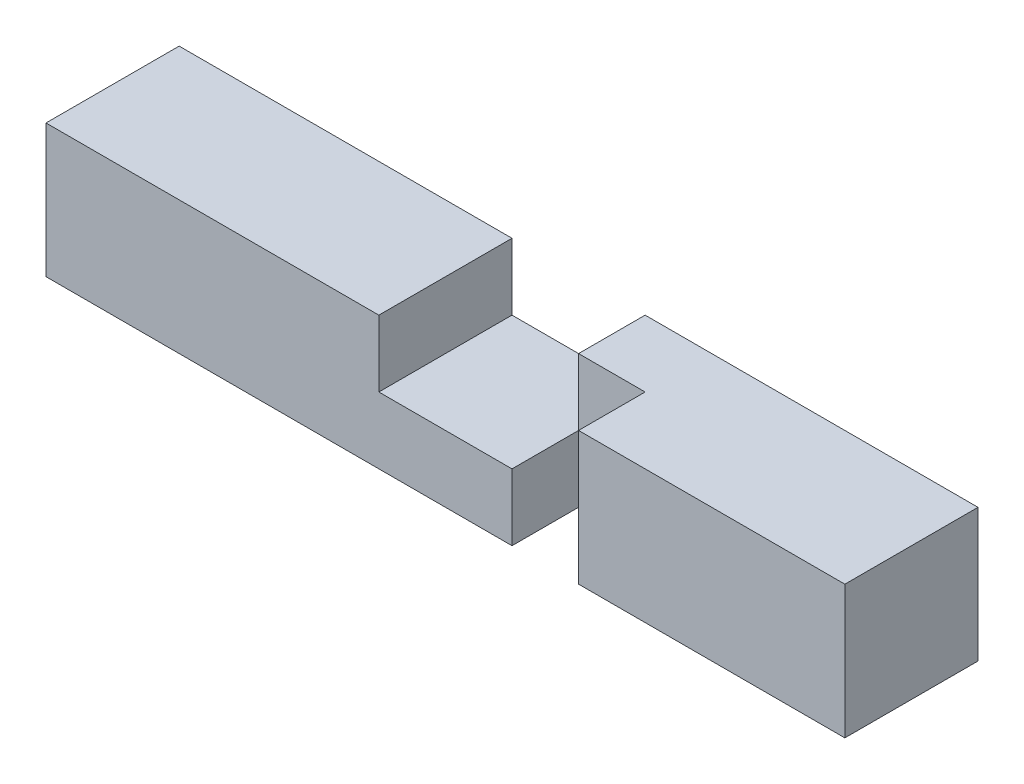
from build123d import *

# Parameters (mm, degrees)
SKETCH1_W      = 120
SKETCH1_H      = 20
EXTRUDE1_DEPTH = 20
SKETCH2_W      = 20
SKETCH2_H      = 10
EXTRUDE2_DEPTH = 124.288280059
SKETCH3_W      = 10
SKETCH3_H      = 10
EXTRUDE3_DEPTH = 124.288280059


with BuildPart() as part:
    # Sketch1 → Extrude1 (new body)
    with BuildSketch(Plane(origin=(0, 0, 0), x_dir=(1, 0, 0), z_dir=(0, 1, 0))):
        with Locations((60, 10)):
            Rectangle(SKETCH1_W, SKETCH1_H)
    extrude(amount=EXTRUDE1_DEPTH)

    # Sketch2 → Extrude2 (cut, through all)
    with BuildSketch(Plane.XY):
        with Locations((60, 15)):
            Rectangle(SKETCH2_W, SKETCH2_H)
    extrude(amount=-EXTRUDE2_DEPTH, mode=Mode.SUBTRACT)

    # Sketch3 → Extrude3 (cut, through all)
    with BuildSketch(Plane(origin=(0, 20, 0), x_dir=(1, 0, 0), z_dir=(0, 1, 0))):
        with Locations((75, 5)):
            Rectangle(SKETCH3_W, SKETCH3_H)
    extrude(amount=-EXTRUDE3_DEPTH, mode=Mode.SUBTRACT)


solid = part.part
